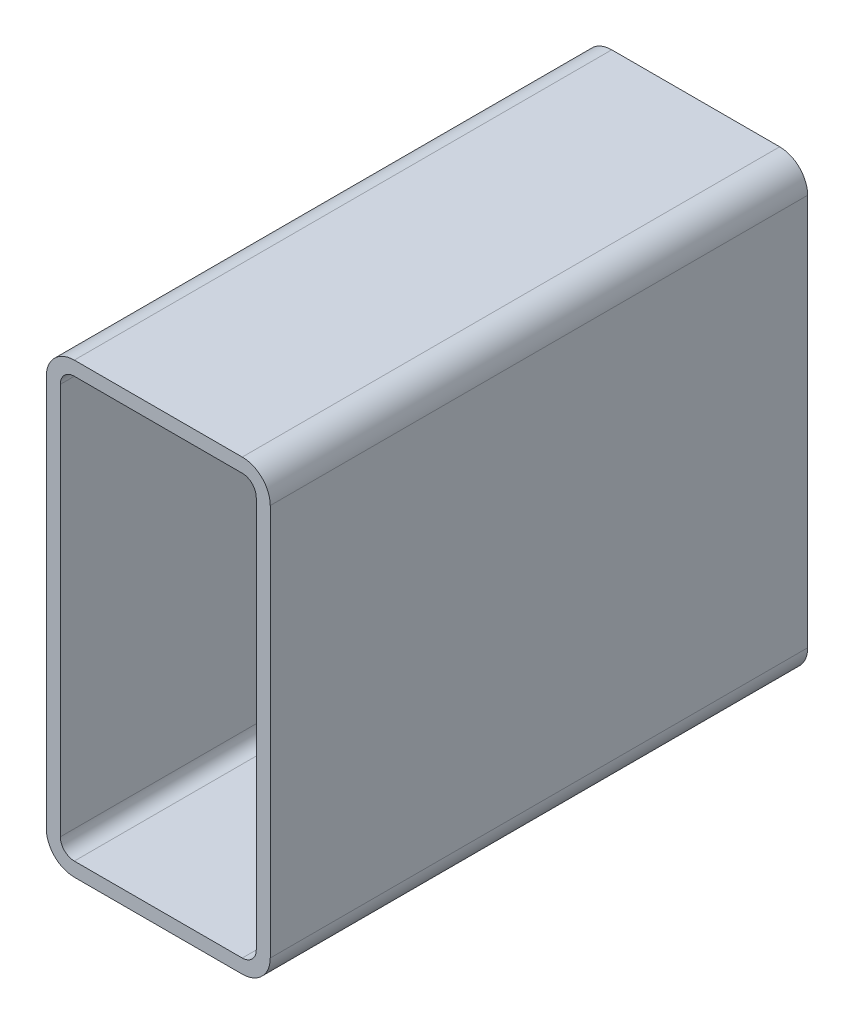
ISO-10303-21;
HEADER;
FILE_DESCRIPTION(('STEP AP214'),'2;1');
FILE_NAME('part.step','',(''),(''),'','','');
FILE_SCHEMA(('AUTOMOTIVE_DESIGN { 1 0 10303 214 1 1 1 1 }'));
ENDSEC;
DATA;
#1=APPLICATION_CONTEXT('core data for automotive mechanical design processes');
#2=APPLICATION_PROTOCOL_DEFINITION('international standard','automotive_design',2000,#1);
#3=PRODUCT_CONTEXT('',#1,'mechanical');
#4=PRODUCT('Part','Part','',(#3));
#5=PRODUCT_RELATED_PRODUCT_CATEGORY('part','',(#4));
#6=PRODUCT_DEFINITION_FORMATION('','',#4);
#7=PRODUCT_DEFINITION_CONTEXT('part definition',#1,'design');
#8=PRODUCT_DEFINITION('design','',#6,#7);
#9=PRODUCT_DEFINITION_SHAPE('','',#8);
#10=(LENGTH_UNIT() NAMED_UNIT(*) SI_UNIT(.MILLI.,.METRE.));
#11=(NAMED_UNIT(*) PLANE_ANGLE_UNIT() SI_UNIT($,.RADIAN.));
#12=(NAMED_UNIT(*) SI_UNIT($,.STERADIAN.) SOLID_ANGLE_UNIT());
#13=UNCERTAINTY_MEASURE_WITH_UNIT(LENGTH_MEASURE(1.E-05),#10,'distance_accuracy_value','');
#14=(GEOMETRIC_REPRESENTATION_CONTEXT(3) GLOBAL_UNCERTAINTY_ASSIGNED_CONTEXT((#13)) GLOBAL_UNIT_ASSIGNED_CONTEXT((#10,
#11,#12)) REPRESENTATION_CONTEXT('',''));
#15=CARTESIAN_POINT('',(0.,0.,0.));
#16=DIRECTION('',(0.,0.,1.));
#17=DIRECTION('',(1.,0.,0.));
#18=AXIS2_PLACEMENT_3D('',#15,#16,#17);
#19=CARTESIAN_POINT('',(16.7362396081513,240.045313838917,304.8));
#20=DIRECTION('',(0.,0.,1.));
#21=DIRECTION('',(1.,0.,0.));
#22=AXIS2_PLACEMENT_3D('',#19,#20,#21);
#23=PLANE('',#22);
#24=CARTESIAN_POINT('',(16.7362396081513,240.045313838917,304.8));
#25=DIRECTION('',(0.,0.,1.));
#26=DIRECTION('',(1.,0.,0.));
#27=AXIS2_PLACEMENT_3D('',#24,#25,#26);
#28=CIRCLE('',#27,15.875);
#29=CARTESIAN_POINT('',(16.7362396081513,255.920313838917,304.8));
#30=VERTEX_POINT('',#29);
#31=CARTESIAN_POINT('',(0.8612396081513,240.045313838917,304.8));
#32=VERTEX_POINT('',#31);
#33=EDGE_CURVE('E211',#30,#32,#28,.T.);
#34=ORIENTED_EDGE('',*,*,#33,.T.);
#35=DIRECTION('',(0.,-1.,0.));
#36=VECTOR('',#35,1.);
#37=CARTESIAN_POINT('',(0.8612396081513,17.7953138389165,304.8));
#38=LINE('',#37,#36);
#39=CARTESIAN_POINT('',(0.8612396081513,17.7953138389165,304.8));
#40=VERTEX_POINT('',#39);
#41=EDGE_CURVE('E214',#32,#40,#38,.T.);
#42=ORIENTED_EDGE('',*,*,#41,.T.);
#43=CARTESIAN_POINT('',(16.7362396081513,17.7953138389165,304.8));
#44=DIRECTION('',(0.,0.,1.));
#45=DIRECTION('',(1.,0.,0.));
#46=AXIS2_PLACEMENT_3D('',#43,#44,#45);
#47=CIRCLE('',#46,15.875);
#48=CARTESIAN_POINT('',(16.7362396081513,1.92031383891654,304.8));
#49=VERTEX_POINT('',#48);
#50=EDGE_CURVE('E217',#40,#49,#47,.T.);
#51=ORIENTED_EDGE('',*,*,#50,.T.);
#52=DIRECTION('',(1.,0.,0.));
#53=VECTOR('',#52,1.);
#54=CARTESIAN_POINT('',(111.986239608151,1.92031383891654,304.8));
#55=LINE('',#54,#53);
#56=CARTESIAN_POINT('',(111.986239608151,1.92031383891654,304.8));
#57=VERTEX_POINT('',#56);
#58=EDGE_CURVE('E219',#49,#57,#55,.T.);
#59=ORIENTED_EDGE('',*,*,#58,.T.);
#60=CARTESIAN_POINT('',(111.986239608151,17.7953138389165,304.8));
#61=DIRECTION('',(0.,0.,1.));
#62=DIRECTION('',(1.,0.,0.));
#63=AXIS2_PLACEMENT_3D('',#60,#61,#62);
#64=CIRCLE('',#63,15.875);
#65=CARTESIAN_POINT('',(127.861239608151,17.7953138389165,304.8));
#66=VERTEX_POINT('',#65);
#67=EDGE_CURVE('E221',#57,#66,#64,.T.);
#68=ORIENTED_EDGE('',*,*,#67,.T.);
#69=DIRECTION('',(0.,1.,0.));
#70=VECTOR('',#69,1.);
#71=CARTESIAN_POINT('',(127.861239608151,240.045313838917,304.8));
#72=LINE('',#71,#70);
#73=CARTESIAN_POINT('',(127.861239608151,240.045313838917,304.8));
#74=VERTEX_POINT('',#73);
#75=EDGE_CURVE('E223',#66,#74,#72,.T.);
#76=ORIENTED_EDGE('',*,*,#75,.T.);
#77=CARTESIAN_POINT('',(111.986239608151,240.045313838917,304.8));
#78=DIRECTION('',(0.,0.,1.));
#79=DIRECTION('',(1.,0.,0.));
#80=AXIS2_PLACEMENT_3D('',#77,#78,#79);
#81=CIRCLE('',#80,15.875);
#82=CARTESIAN_POINT('',(111.986239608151,255.920313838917,304.8));
#83=VERTEX_POINT('',#82);
#84=EDGE_CURVE('E225',#74,#83,#81,.T.);
#85=ORIENTED_EDGE('',*,*,#84,.T.);
#86=DIRECTION('',(-1.,0.,0.));
#87=VECTOR('',#86,1.);
#88=CARTESIAN_POINT('',(16.7362396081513,255.920313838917,304.8));
#89=LINE('',#88,#87);
#90=EDGE_CURVE('E227',#83,#30,#89,.T.);
#91=ORIENTED_EDGE('',*,*,#90,.T.);
#92=EDGE_LOOP('',(#34,#42,#51,#59,#68,#76,#85,#91));
#93=FACE_BOUND('',#92,.T.);
#94=DIRECTION('',(0.,-1.,0.));
#95=VECTOR('',#94,1.);
#96=CARTESIAN_POINT('',(8.7987396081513,17.7953138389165,304.8));
#97=LINE('',#96,#95);
#98=CARTESIAN_POINT('',(8.7987396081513,240.045313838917,304.8));
#99=VERTEX_POINT('',#98);
#100=CARTESIAN_POINT('',(8.7987396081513,17.7953138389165,304.8));
#101=VERTEX_POINT('',#100);
#102=EDGE_CURVE('E154',#99,#101,#97,.T.);
#103=ORIENTED_EDGE('',*,*,#102,.F.);
#104=CARTESIAN_POINT('',(16.7362396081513,240.045313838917,304.8));
#105=DIRECTION('',(0.,0.,1.));
#106=DIRECTION('',(1.,0.,0.));
#107=AXIS2_PLACEMENT_3D('',#104,#105,#106);
#108=CIRCLE('',#107,7.9375);
#109=CARTESIAN_POINT('',(16.7362396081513,247.982813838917,304.8));
#110=VERTEX_POINT('',#109);
#111=EDGE_CURVE('E146',#110,#99,#108,.T.);
#112=ORIENTED_EDGE('',*,*,#111,.F.);
#113=DIRECTION('',(-1.,0.,0.));
#114=VECTOR('',#113,1.);
#115=CARTESIAN_POINT('',(16.7362396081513,247.982813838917,304.8));
#116=LINE('',#115,#114);
#117=CARTESIAN_POINT('',(111.986239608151,247.982813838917,304.8));
#118=VERTEX_POINT('',#117);
#119=EDGE_CURVE('E179',#118,#110,#116,.T.);
#120=ORIENTED_EDGE('',*,*,#119,.F.);
#121=CARTESIAN_POINT('',(111.986239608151,240.045313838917,304.8));
#122=DIRECTION('',(0.,0.,1.));
#123=DIRECTION('',(1.,0.,0.));
#124=AXIS2_PLACEMENT_3D('',#121,#122,#123);
#125=CIRCLE('',#124,7.93749999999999);
#126=CARTESIAN_POINT('',(119.923739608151,240.045313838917,304.8));
#127=VERTEX_POINT('',#126);
#128=EDGE_CURVE('E177',#127,#118,#125,.T.);
#129=ORIENTED_EDGE('',*,*,#128,.F.);
#130=DIRECTION('',(0.,1.,0.));
#131=VECTOR('',#130,1.);
#132=CARTESIAN_POINT('',(119.923739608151,240.045313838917,304.8));
#133=LINE('',#132,#131);
#134=CARTESIAN_POINT('',(119.923739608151,17.7953138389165,304.8));
#135=VERTEX_POINT('',#134);
#136=EDGE_CURVE('E175',#135,#127,#133,.T.);
#137=ORIENTED_EDGE('',*,*,#136,.F.);
#138=CARTESIAN_POINT('',(111.986239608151,17.7953138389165,304.8));
#139=DIRECTION('',(0.,0.,1.));
#140=DIRECTION('',(1.,0.,0.));
#141=AXIS2_PLACEMENT_3D('',#138,#139,#140);
#142=CIRCLE('',#141,7.9375);
#143=CARTESIAN_POINT('',(111.986239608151,9.85781383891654,304.8));
#144=VERTEX_POINT('',#143);
#145=EDGE_CURVE('E173',#144,#135,#142,.T.);
#146=ORIENTED_EDGE('',*,*,#145,.F.);
#147=DIRECTION('',(1.,0.,0.));
#148=VECTOR('',#147,1.);
#149=CARTESIAN_POINT('',(111.986239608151,9.85781383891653,304.8));
#150=LINE('',#149,#148);
#151=CARTESIAN_POINT('',(16.7362396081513,9.85781383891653,304.8));
#152=VERTEX_POINT('',#151);
#153=EDGE_CURVE('E169',#152,#144,#150,.T.);
#154=ORIENTED_EDGE('',*,*,#153,.F.);
#155=CARTESIAN_POINT('',(16.7362396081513,17.7953138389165,304.8));
#156=DIRECTION('',(0.,0.,1.));
#157=DIRECTION('',(1.,0.,0.));
#158=AXIS2_PLACEMENT_3D('',#155,#156,#157);
#159=CIRCLE('',#158,7.9375);
#160=EDGE_CURVE('E167',#101,#152,#159,.T.);
#161=ORIENTED_EDGE('',*,*,#160,.F.);
#162=EDGE_LOOP('',(#103,#112,#120,#129,#137,#146,#154,#161));
#163=FACE_BOUND('',#162,.T.);
#164=ADVANCED_FACE('F33',(#93,#163),#23,.T.);
#165=CARTESIAN_POINT('',(16.7362396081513,240.045313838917,0.));
#166=DIRECTION('',(0.,0.,1.));
#167=DIRECTION('',(1.,0.,0.));
#168=AXIS2_PLACEMENT_3D('',#165,#166,#167);
#169=PLANE('',#168);
#170=CARTESIAN_POINT('',(16.7362396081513,240.045313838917,0.));
#171=DIRECTION('',(0.,0.,1.));
#172=DIRECTION('',(1.,0.,0.));
#173=AXIS2_PLACEMENT_3D('',#170,#171,#172);
#174=CIRCLE('',#173,15.875);
#175=CARTESIAN_POINT('',(16.7362396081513,255.920313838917,0.));
#176=VERTEX_POINT('',#175);
#177=CARTESIAN_POINT('',(0.8612396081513,240.045313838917,0.));
#178=VERTEX_POINT('',#177);
#179=EDGE_CURVE('E162',#176,#178,#174,.T.);
#180=ORIENTED_EDGE('',*,*,#179,.F.);
#181=DIRECTION('',(-1.,0.,0.));
#182=VECTOR('',#181,1.);
#183=CARTESIAN_POINT('',(16.7362396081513,255.920313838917,0.));
#184=LINE('',#183,#182);
#185=CARTESIAN_POINT('',(111.986239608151,255.920313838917,0.));
#186=VERTEX_POINT('',#185);
#187=EDGE_CURVE('E215',#186,#176,#184,.T.);
#188=ORIENTED_EDGE('',*,*,#187,.F.);
#189=CARTESIAN_POINT('',(111.986239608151,240.045313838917,0.));
#190=DIRECTION('',(0.,0.,1.));
#191=DIRECTION('',(1.,0.,0.));
#192=AXIS2_PLACEMENT_3D('',#189,#190,#191);
#193=CIRCLE('',#192,15.875);
#194=CARTESIAN_POINT('',(127.861239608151,240.045313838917,0.));
#195=VERTEX_POINT('',#194);
#196=EDGE_CURVE('E242',#195,#186,#193,.T.);
#197=ORIENTED_EDGE('',*,*,#196,.F.);
#198=DIRECTION('',(0.,1.,0.));
#199=VECTOR('',#198,1.);
#200=CARTESIAN_POINT('',(127.861239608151,240.045313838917,0.));
#201=LINE('',#200,#199);
#202=CARTESIAN_POINT('',(127.861239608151,17.7953138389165,0.));
#203=VERTEX_POINT('',#202);
#204=EDGE_CURVE('E240',#203,#195,#201,.T.);
#205=ORIENTED_EDGE('',*,*,#204,.F.);
#206=CARTESIAN_POINT('',(111.986239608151,17.7953138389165,0.));
#207=DIRECTION('',(0.,0.,1.));
#208=DIRECTION('',(1.,0.,0.));
#209=AXIS2_PLACEMENT_3D('',#206,#207,#208);
#210=CIRCLE('',#209,15.875);
#211=CARTESIAN_POINT('',(111.986239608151,1.92031383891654,0.));
#212=VERTEX_POINT('',#211);
#213=EDGE_CURVE('E238',#212,#203,#210,.T.);
#214=ORIENTED_EDGE('',*,*,#213,.F.);
#215=DIRECTION('',(1.,0.,0.));
#216=VECTOR('',#215,1.);
#217=CARTESIAN_POINT('',(111.986239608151,1.92031383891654,0.));
#218=LINE('',#217,#216);
#219=CARTESIAN_POINT('',(16.7362396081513,1.92031383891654,0.));
#220=VERTEX_POINT('',#219);
#221=EDGE_CURVE('E236',#220,#212,#218,.T.);
#222=ORIENTED_EDGE('',*,*,#221,.F.);
#223=CARTESIAN_POINT('',(16.7362396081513,17.7953138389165,0.));
#224=DIRECTION('',(0.,0.,1.));
#225=DIRECTION('',(1.,0.,0.));
#226=AXIS2_PLACEMENT_3D('',#223,#224,#225);
#227=CIRCLE('',#226,15.875);
#228=CARTESIAN_POINT('',(0.8612396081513,17.7953138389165,0.));
#229=VERTEX_POINT('',#228);
#230=EDGE_CURVE('E234',#229,#220,#227,.T.);
#231=ORIENTED_EDGE('',*,*,#230,.F.);
#232=DIRECTION('',(0.,-1.,0.));
#233=VECTOR('',#232,1.);
#234=CARTESIAN_POINT('',(0.8612396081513,17.7953138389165,0.));
#235=LINE('',#234,#233);
#236=EDGE_CURVE('E232',#178,#229,#235,.T.);
#237=ORIENTED_EDGE('',*,*,#236,.F.);
#238=EDGE_LOOP('',(#180,#188,#197,#205,#214,#222,#231,#237));
#239=FACE_BOUND('',#238,.T.);
#240=CARTESIAN_POINT('',(16.7362396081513,240.045313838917,0.));
#241=DIRECTION('',(0.,0.,1.));
#242=DIRECTION('',(1.,0.,0.));
#243=AXIS2_PLACEMENT_3D('',#240,#241,#242);
#244=CIRCLE('',#243,7.9375);
#245=CARTESIAN_POINT('',(16.7362396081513,247.982813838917,0.));
#246=VERTEX_POINT('',#245);
#247=CARTESIAN_POINT('',(8.7987396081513,240.045313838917,0.));
#248=VERTEX_POINT('',#247);
#249=EDGE_CURVE('E56',#246,#248,#244,.T.);
#250=ORIENTED_EDGE('',*,*,#249,.T.);
#251=DIRECTION('',(0.,-1.,0.));
#252=VECTOR('',#251,1.);
#253=CARTESIAN_POINT('',(8.7987396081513,17.7953138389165,0.));
#254=LINE('',#253,#252);
#255=CARTESIAN_POINT('',(8.7987396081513,17.7953138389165,0.));
#256=VERTEX_POINT('',#255);
#257=EDGE_CURVE('E161',#248,#256,#254,.T.);
#258=ORIENTED_EDGE('',*,*,#257,.T.);
#259=CARTESIAN_POINT('',(16.7362396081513,17.7953138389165,0.));
#260=DIRECTION('',(0.,0.,1.));
#261=DIRECTION('',(1.,0.,0.));
#262=AXIS2_PLACEMENT_3D('',#259,#260,#261);
#263=CIRCLE('',#262,7.9375);
#264=CARTESIAN_POINT('',(16.7362396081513,9.85781383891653,0.));
#265=VERTEX_POINT('',#264);
#266=EDGE_CURVE('E183',#256,#265,#263,.T.);
#267=ORIENTED_EDGE('',*,*,#266,.T.);
#268=DIRECTION('',(1.,0.,0.));
#269=VECTOR('',#268,1.);
#270=CARTESIAN_POINT('',(111.986239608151,9.85781383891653,0.));
#271=LINE('',#270,#269);
#272=CARTESIAN_POINT('',(111.986239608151,9.85781383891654,0.));
#273=VERTEX_POINT('',#272);
#274=EDGE_CURVE('E186',#265,#273,#271,.T.);
#275=ORIENTED_EDGE('',*,*,#274,.T.);
#276=CARTESIAN_POINT('',(111.986239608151,17.7953138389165,0.));
#277=DIRECTION('',(0.,0.,1.));
#278=DIRECTION('',(1.,0.,0.));
#279=AXIS2_PLACEMENT_3D('',#276,#277,#278);
#280=CIRCLE('',#279,7.9375);
#281=CARTESIAN_POINT('',(119.923739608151,17.7953138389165,0.));
#282=VERTEX_POINT('',#281);
#283=EDGE_CURVE('E189',#273,#282,#280,.T.);
#284=ORIENTED_EDGE('',*,*,#283,.T.);
#285=DIRECTION('',(0.,1.,0.));
#286=VECTOR('',#285,1.);
#287=CARTESIAN_POINT('',(119.923739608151,240.045313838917,0.));
#288=LINE('',#287,#286);
#289=CARTESIAN_POINT('',(119.923739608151,240.045313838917,0.));
#290=VERTEX_POINT('',#289);
#291=EDGE_CURVE('E192',#282,#290,#288,.T.);
#292=ORIENTED_EDGE('',*,*,#291,.T.);
#293=CARTESIAN_POINT('',(111.986239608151,240.045313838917,0.));
#294=DIRECTION('',(0.,0.,1.));
#295=DIRECTION('',(1.,0.,0.));
#296=AXIS2_PLACEMENT_3D('',#293,#294,#295);
#297=CIRCLE('',#296,7.93749999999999);
#298=CARTESIAN_POINT('',(111.986239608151,247.982813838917,0.));
#299=VERTEX_POINT('',#298);
#300=EDGE_CURVE('E195',#290,#299,#297,.T.);
#301=ORIENTED_EDGE('',*,*,#300,.T.);
#302=DIRECTION('',(-1.,0.,0.));
#303=VECTOR('',#302,1.);
#304=CARTESIAN_POINT('',(16.7362396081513,247.982813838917,0.));
#305=LINE('',#304,#303);
#306=EDGE_CURVE('E155',#299,#246,#305,.T.);
#307=ORIENTED_EDGE('',*,*,#306,.T.);
#308=EDGE_LOOP('',(#250,#258,#267,#275,#284,#292,#301,#307));
#309=FACE_BOUND('',#308,.T.);
#310=ADVANCED_FACE('F272',(#239,#309),#169,.F.);
#311=CARTESIAN_POINT('',(16.7362396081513,240.045313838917,304.8));
#312=DIRECTION('',(0.,0.,-1.));
#313=DIRECTION('',(-1.,0.,0.));
#314=AXIS2_PLACEMENT_3D('',#311,#312,#313);
#315=CYLINDRICAL_SURFACE('',#314,15.875);
#316=ORIENTED_EDGE('',*,*,#179,.T.);
#317=DIRECTION('',(0.,0.,-1.));
#318=VECTOR('',#317,1.);
#319=CARTESIAN_POINT('',(0.8612396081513,240.045313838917,304.8));
#320=LINE('',#319,#318);
#321=EDGE_CURVE('E11',#32,#178,#320,.T.);
#322=ORIENTED_EDGE('',*,*,#321,.F.);
#323=ORIENTED_EDGE('',*,*,#33,.F.);
#324=DIRECTION('',(0.,0.,-1.));
#325=VECTOR('',#324,1.);
#326=CARTESIAN_POINT('',(16.7362396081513,255.920313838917,304.8));
#327=LINE('',#326,#325);
#328=EDGE_CURVE('E229',#30,#176,#327,.T.);
#329=ORIENTED_EDGE('',*,*,#328,.T.);
#330=EDGE_LOOP('',(#316,#322,#323,#329));
#331=FACE_BOUND('',#330,.T.);
#332=ADVANCED_FACE('F35',(#331),#315,.T.);
#333=CARTESIAN_POINT('',(0.8612396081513,17.7953138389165,304.8));
#334=DIRECTION('',(1.,0.,0.));
#335=DIRECTION('',(0.,0.,-1.));
#336=AXIS2_PLACEMENT_3D('',#333,#334,#335);
#337=PLANE('',#336);
#338=ORIENTED_EDGE('',*,*,#236,.T.);
#339=DIRECTION('',(0.,0.,-1.));
#340=VECTOR('',#339,1.);
#341=CARTESIAN_POINT('',(0.8612396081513,17.7953138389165,304.8));
#342=LINE('',#341,#340);
#343=EDGE_CURVE('E41',#40,#229,#342,.T.);
#344=ORIENTED_EDGE('',*,*,#343,.F.);
#345=ORIENTED_EDGE('',*,*,#41,.F.);
#346=ORIENTED_EDGE('',*,*,#321,.T.);
#347=EDGE_LOOP('',(#338,#344,#345,#346));
#348=FACE_BOUND('',#347,.T.);
#349=ADVANCED_FACE('F289',(#348),#337,.F.);
#350=CARTESIAN_POINT('',(16.7362396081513,17.7953138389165,304.8));
#351=DIRECTION('',(0.,0.,-1.));
#352=DIRECTION('',(-1.,0.,0.));
#353=AXIS2_PLACEMENT_3D('',#350,#351,#352);
#354=CYLINDRICAL_SURFACE('',#353,15.875);
#355=ORIENTED_EDGE('',*,*,#230,.T.);
#356=DIRECTION('',(0.,0.,-1.));
#357=VECTOR('',#356,1.);
#358=CARTESIAN_POINT('',(16.7362396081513,1.92031383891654,304.8));
#359=LINE('',#358,#357);
#360=EDGE_CURVE('E259',#49,#220,#359,.T.);
#361=ORIENTED_EDGE('',*,*,#360,.F.);
#362=ORIENTED_EDGE('',*,*,#50,.F.);
#363=ORIENTED_EDGE('',*,*,#343,.T.);
#364=EDGE_LOOP('',(#355,#361,#362,#363));
#365=FACE_BOUND('',#364,.T.);
#366=ADVANCED_FACE('F266',(#365),#354,.T.);
#367=CARTESIAN_POINT('',(111.986239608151,1.92031383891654,304.8));
#368=DIRECTION('',(0.,1.,0.));
#369=DIRECTION('',(0.,0.,1.));
#370=AXIS2_PLACEMENT_3D('',#367,#368,#369);
#371=PLANE('',#370);
#372=ORIENTED_EDGE('',*,*,#221,.T.);
#373=DIRECTION('',(0.,0.,-1.));
#374=VECTOR('',#373,1.);
#375=CARTESIAN_POINT('',(111.986239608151,1.92031383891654,304.8));
#376=LINE('',#375,#374);
#377=EDGE_CURVE('E256',#57,#212,#376,.T.);
#378=ORIENTED_EDGE('',*,*,#377,.F.);
#379=ORIENTED_EDGE('',*,*,#58,.F.);
#380=ORIENTED_EDGE('',*,*,#360,.T.);
#381=EDGE_LOOP('',(#372,#378,#379,#380));
#382=FACE_BOUND('',#381,.T.);
#383=ADVANCED_FACE('F278',(#382),#371,.F.);
#384=CARTESIAN_POINT('',(111.986239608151,17.7953138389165,304.8));
#385=DIRECTION('',(0.,0.,-1.));
#386=DIRECTION('',(-1.,0.,0.));
#387=AXIS2_PLACEMENT_3D('',#384,#385,#386);
#388=CYLINDRICAL_SURFACE('',#387,15.875);
#389=ORIENTED_EDGE('',*,*,#213,.T.);
#390=DIRECTION('',(0.,0.,-1.));
#391=VECTOR('',#390,1.);
#392=CARTESIAN_POINT('',(127.861239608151,17.7953138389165,304.8));
#393=LINE('',#392,#391);
#394=EDGE_CURVE('E253',#66,#203,#393,.T.);
#395=ORIENTED_EDGE('',*,*,#394,.F.);
#396=ORIENTED_EDGE('',*,*,#67,.F.);
#397=ORIENTED_EDGE('',*,*,#377,.T.);
#398=EDGE_LOOP('',(#389,#395,#396,#397));
#399=FACE_BOUND('',#398,.T.);
#400=ADVANCED_FACE('F282',(#399),#388,.T.);
#401=CARTESIAN_POINT('',(127.861239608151,240.045313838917,304.8));
#402=DIRECTION('',(-1.,0.,0.));
#403=DIRECTION('',(0.,0.,1.));
#404=AXIS2_PLACEMENT_3D('',#401,#402,#403);
#405=PLANE('',#404);
#406=ORIENTED_EDGE('',*,*,#204,.T.);
#407=DIRECTION('',(0.,0.,-1.));
#408=VECTOR('',#407,1.);
#409=CARTESIAN_POINT('',(127.861239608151,240.045313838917,304.8));
#410=LINE('',#409,#408);
#411=EDGE_CURVE('E250',#74,#195,#410,.T.);
#412=ORIENTED_EDGE('',*,*,#411,.F.);
#413=ORIENTED_EDGE('',*,*,#75,.F.);
#414=ORIENTED_EDGE('',*,*,#394,.T.);
#415=EDGE_LOOP('',(#406,#412,#413,#414));
#416=FACE_BOUND('',#415,.T.);
#417=ADVANCED_FACE('F302',(#416),#405,.F.);
#418=CARTESIAN_POINT('',(111.986239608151,240.045313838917,304.8));
#419=DIRECTION('',(0.,0.,-1.));
#420=DIRECTION('',(-1.,0.,0.));
#421=AXIS2_PLACEMENT_3D('',#418,#419,#420);
#422=CYLINDRICAL_SURFACE('',#421,15.875);
#423=ORIENTED_EDGE('',*,*,#196,.T.);
#424=DIRECTION('',(0.,0.,-1.));
#425=VECTOR('',#424,1.);
#426=CARTESIAN_POINT('',(111.986239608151,255.920313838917,304.8));
#427=LINE('',#426,#425);
#428=EDGE_CURVE('E247',#83,#186,#427,.T.);
#429=ORIENTED_EDGE('',*,*,#428,.F.);
#430=ORIENTED_EDGE('',*,*,#84,.F.);
#431=ORIENTED_EDGE('',*,*,#411,.T.);
#432=EDGE_LOOP('',(#423,#429,#430,#431));
#433=FACE_BOUND('',#432,.T.);
#434=ADVANCED_FACE('F300',(#433),#422,.T.);
#435=CARTESIAN_POINT('',(16.7362396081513,255.920313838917,304.8));
#436=DIRECTION('',(0.,-1.,0.));
#437=DIRECTION('',(0.,0.,-1.));
#438=AXIS2_PLACEMENT_3D('',#435,#436,#437);
#439=PLANE('',#438);
#440=ORIENTED_EDGE('',*,*,#187,.T.);
#441=ORIENTED_EDGE('',*,*,#328,.F.);
#442=ORIENTED_EDGE('',*,*,#90,.F.);
#443=ORIENTED_EDGE('',*,*,#428,.T.);
#444=EDGE_LOOP('',(#440,#441,#442,#443));
#445=FACE_BOUND('',#444,.T.);
#446=ADVANCED_FACE('F295',(#445),#439,.F.);
#447=CARTESIAN_POINT('',(16.7362396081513,240.045313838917,304.8));
#448=DIRECTION('',(0.,0.,-1.));
#449=DIRECTION('',(-1.,0.,0.));
#450=AXIS2_PLACEMENT_3D('',#447,#448,#449);
#451=CYLINDRICAL_SURFACE('',#450,7.9375);
#452=ORIENTED_EDGE('',*,*,#249,.F.);
#453=DIRECTION('',(0.,0.,-1.));
#454=VECTOR('',#453,1.);
#455=CARTESIAN_POINT('',(16.7362396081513,247.982813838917,304.8));
#456=LINE('',#455,#454);
#457=EDGE_CURVE('E150',#110,#246,#456,.T.);
#458=ORIENTED_EDGE('',*,*,#457,.F.);
#459=ORIENTED_EDGE('',*,*,#111,.T.);
#460=DIRECTION('',(0.,0.,-1.));
#461=VECTOR('',#460,1.);
#462=CARTESIAN_POINT('',(8.7987396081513,240.045313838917,304.8));
#463=LINE('',#462,#461);
#464=EDGE_CURVE('E149',#99,#248,#463,.T.);
#465=ORIENTED_EDGE('',*,*,#464,.T.);
#466=EDGE_LOOP('',(#452,#458,#459,#465));
#467=FACE_BOUND('',#466,.T.);
#468=ADVANCED_FACE('F148',(#467),#451,.F.);
#469=CARTESIAN_POINT('',(8.7987396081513,17.7953138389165,304.8));
#470=DIRECTION('',(1.,0.,0.));
#471=DIRECTION('',(0.,0.,-1.));
#472=AXIS2_PLACEMENT_3D('',#469,#470,#471);
#473=PLANE('',#472);
#474=ORIENTED_EDGE('',*,*,#257,.F.);
#475=ORIENTED_EDGE('',*,*,#464,.F.);
#476=ORIENTED_EDGE('',*,*,#102,.T.);
#477=DIRECTION('',(0.,0.,-1.));
#478=VECTOR('',#477,1.);
#479=CARTESIAN_POINT('',(8.7987396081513,17.7953138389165,304.8));
#480=LINE('',#479,#478);
#481=EDGE_CURVE('E163',#101,#256,#480,.T.);
#482=ORIENTED_EDGE('',*,*,#481,.T.);
#483=EDGE_LOOP('',(#474,#475,#476,#482));
#484=FACE_BOUND('',#483,.T.);
#485=ADVANCED_FACE('F158',(#484),#473,.T.);
#486=CARTESIAN_POINT('',(16.7362396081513,17.7953138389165,304.8));
#487=DIRECTION('',(0.,0.,-1.));
#488=DIRECTION('',(-1.,0.,0.));
#489=AXIS2_PLACEMENT_3D('',#486,#487,#488);
#490=CYLINDRICAL_SURFACE('',#489,7.9375);
#491=ORIENTED_EDGE('',*,*,#266,.F.);
#492=ORIENTED_EDGE('',*,*,#481,.F.);
#493=ORIENTED_EDGE('',*,*,#160,.T.);
#494=DIRECTION('',(0.,0.,-1.));
#495=VECTOR('',#494,1.);
#496=CARTESIAN_POINT('',(16.7362396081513,9.85781383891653,304.8));
#497=LINE('',#496,#495);
#498=EDGE_CURVE('E208',#152,#265,#497,.T.);
#499=ORIENTED_EDGE('',*,*,#498,.T.);
#500=EDGE_LOOP('',(#491,#492,#493,#499));
#501=FACE_BOUND('',#500,.T.);
#502=ADVANCED_FACE('F327',(#501),#490,.F.);
#503=CARTESIAN_POINT('',(111.986239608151,9.85781383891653,304.8));
#504=DIRECTION('',(0.,1.,0.));
#505=DIRECTION('',(0.,0.,1.));
#506=AXIS2_PLACEMENT_3D('',#503,#504,#505);
#507=PLANE('',#506);
#508=ORIENTED_EDGE('',*,*,#274,.F.);
#509=ORIENTED_EDGE('',*,*,#498,.F.);
#510=ORIENTED_EDGE('',*,*,#153,.T.);
#511=DIRECTION('',(0.,0.,-1.));
#512=VECTOR('',#511,1.);
#513=CARTESIAN_POINT('',(111.986239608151,9.85781383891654,304.8));
#514=LINE('',#513,#512);
#515=EDGE_CURVE('E206',#144,#273,#514,.T.);
#516=ORIENTED_EDGE('',*,*,#515,.T.);
#517=EDGE_LOOP('',(#508,#509,#510,#516));
#518=FACE_BOUND('',#517,.T.);
#519=ADVANCED_FACE('F331',(#518),#507,.T.);
#520=CARTESIAN_POINT('',(111.986239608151,17.7953138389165,304.8));
#521=DIRECTION('',(0.,0.,-1.));
#522=DIRECTION('',(-1.,0.,0.));
#523=AXIS2_PLACEMENT_3D('',#520,#521,#522);
#524=CYLINDRICAL_SURFACE('',#523,7.9375);
#525=ORIENTED_EDGE('',*,*,#283,.F.);
#526=ORIENTED_EDGE('',*,*,#515,.F.);
#527=ORIENTED_EDGE('',*,*,#145,.T.);
#528=DIRECTION('',(0.,0.,-1.));
#529=VECTOR('',#528,1.);
#530=CARTESIAN_POINT('',(119.923739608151,17.7953138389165,304.8));
#531=LINE('',#530,#529);
#532=EDGE_CURVE('E204',#135,#282,#531,.T.);
#533=ORIENTED_EDGE('',*,*,#532,.T.);
#534=EDGE_LOOP('',(#525,#526,#527,#533));
#535=FACE_BOUND('',#534,.T.);
#536=ADVANCED_FACE('F337',(#535),#524,.F.);
#537=CARTESIAN_POINT('',(119.923739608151,240.045313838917,304.8));
#538=DIRECTION('',(-1.,0.,0.));
#539=DIRECTION('',(0.,0.,1.));
#540=AXIS2_PLACEMENT_3D('',#537,#538,#539);
#541=PLANE('',#540);
#542=ORIENTED_EDGE('',*,*,#291,.F.);
#543=ORIENTED_EDGE('',*,*,#532,.F.);
#544=ORIENTED_EDGE('',*,*,#136,.T.);
#545=DIRECTION('',(0.,0.,-1.));
#546=VECTOR('',#545,1.);
#547=CARTESIAN_POINT('',(119.923739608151,240.045313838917,304.8));
#548=LINE('',#547,#546);
#549=EDGE_CURVE('E202',#127,#290,#548,.T.);
#550=ORIENTED_EDGE('',*,*,#549,.T.);
#551=EDGE_LOOP('',(#542,#543,#544,#550));
#552=FACE_BOUND('',#551,.T.);
#553=ADVANCED_FACE('F341',(#552),#541,.T.);
#554=CARTESIAN_POINT('',(111.986239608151,240.045313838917,304.8));
#555=DIRECTION('',(0.,0.,-1.));
#556=DIRECTION('',(-1.,0.,0.));
#557=AXIS2_PLACEMENT_3D('',#554,#555,#556);
#558=CYLINDRICAL_SURFACE('',#557,7.93749999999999);
#559=ORIENTED_EDGE('',*,*,#300,.F.);
#560=ORIENTED_EDGE('',*,*,#549,.F.);
#561=ORIENTED_EDGE('',*,*,#128,.T.);
#562=DIRECTION('',(0.,0.,-1.));
#563=VECTOR('',#562,1.);
#564=CARTESIAN_POINT('',(111.986239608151,247.982813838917,304.8));
#565=LINE('',#564,#563);
#566=EDGE_CURVE('E48',#118,#299,#565,.T.);
#567=ORIENTED_EDGE('',*,*,#566,.T.);
#568=EDGE_LOOP('',(#559,#560,#561,#567));
#569=FACE_BOUND('',#568,.T.);
#570=ADVANCED_FACE('F345',(#569),#558,.F.);
#571=CARTESIAN_POINT('',(16.7362396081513,247.982813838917,304.8));
#572=DIRECTION('',(0.,-1.,0.));
#573=DIRECTION('',(0.,0.,-1.));
#574=AXIS2_PLACEMENT_3D('',#571,#572,#573);
#575=PLANE('',#574);
#576=ORIENTED_EDGE('',*,*,#306,.F.);
#577=ORIENTED_EDGE('',*,*,#566,.F.);
#578=ORIENTED_EDGE('',*,*,#119,.T.);
#579=ORIENTED_EDGE('',*,*,#457,.T.);
#580=EDGE_LOOP('',(#576,#577,#578,#579));
#581=FACE_BOUND('',#580,.T.);
#582=ADVANCED_FACE('F349',(#581),#575,.T.);
#583=CLOSED_SHELL('',(#164,#310,#332,#349,#366,#383,#400,#417,#434,#446,#468,#485,#502,#519,
#536,#553,#570,#582));
#584=MANIFOLD_SOLID_BREP('B2',#583);
#585=ADVANCED_BREP_SHAPE_REPRESENTATION('',(#18,#584),#14);
#586=SHAPE_DEFINITION_REPRESENTATION(#9,#585);
ENDSEC;
END-ISO-10303-21;
